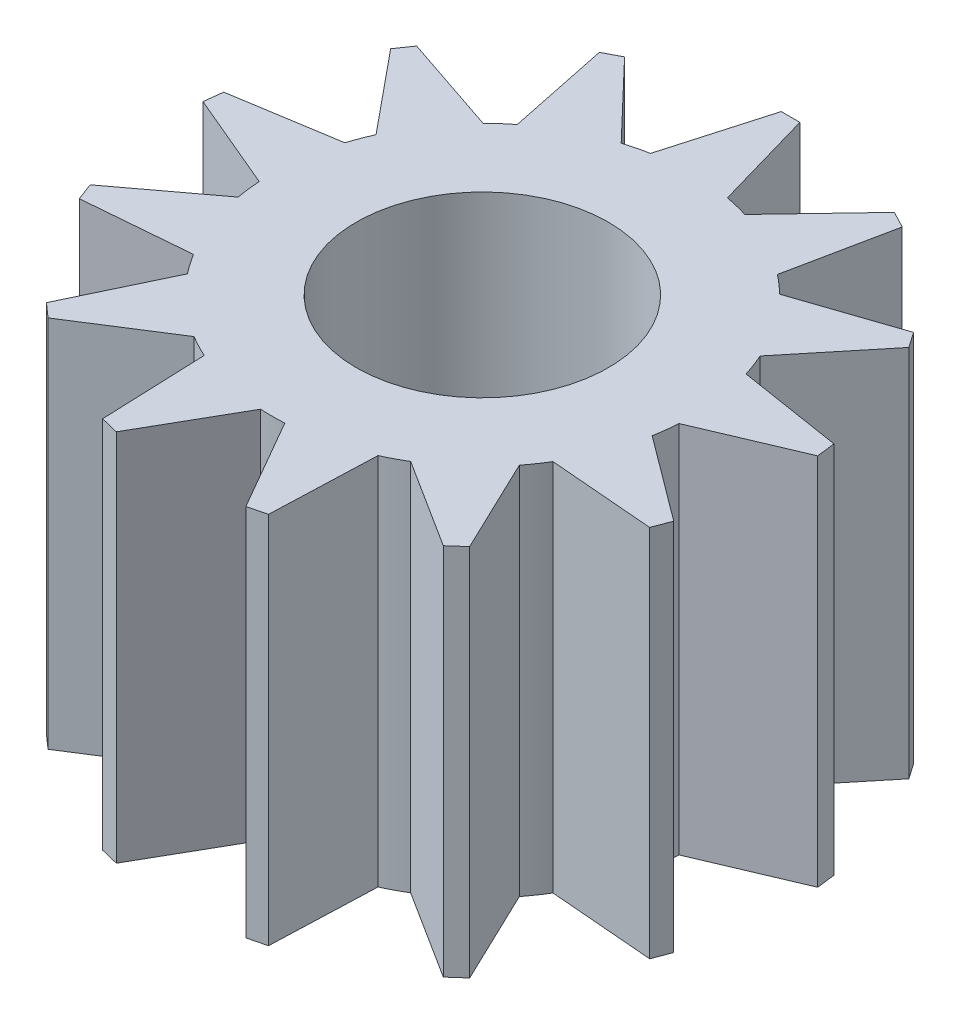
from build123d import *

# Parameters (mm, degrees)
SKETCH_1_R               = 4.5
SKETCH_1_R_2             = 2.7
EXTRUDE_1_DEPTH          = 8
EXTRUDE_2_DEPTH          = 8
PATTERN_CIRCULAR_1_COUNT = 13
PATTERN_CIRCULAR_1_ANGLE = 332.4


with BuildPart() as part:
    # Sketch 1 → Extrude 1 (new body)
    with BuildSketch(Plane(origin=(0, 0, 0), x_dir=(1, 0, 0), z_dir=(0, 1, 0))):
        with Locations(Location((-6.516055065, 1.577878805, 0), (0, 0, 270))):
            Circle(SKETCH_1_R)
        with Locations(Location((-6.516055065, 1.577878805, 0), (0, 0, 270))):
            Circle(SKETCH_1_R_2, mode=Mode.SUBTRACT)
    extrude(amount=EXTRUDE_1_DEPTH)

    # Sketch 1_3 → Extrude 2 (add)
    with BuildSketch(Plane(origin=(0, 0, 0), x_dir=(1, 0, 0), z_dir=(0, 1, 0))):
        with BuildLine():
            Line((-6.316055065, 8.177878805), (-6.516055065, 8.177878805))
            Line((-6.516055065, 8.177878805), (-6.716055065, 8.177878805))
            Line((-6.716055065, 8.177878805), (-7.340036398, 6.00179729))
            ThreePointArc((-7.340036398, 6.00179729), (-6.516055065, 6.077878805), (-5.692073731, 6.00179729))
            Line((-5.692073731, 6.00179729), (-6.316055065, 8.177878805))
        make_face()
    extrude_2 = extrude(amount=EXTRUDE_2_DEPTH)

    # Pattern Circular 1: Extrude 2 ×13 about axis
    pattern_circular_1_axis = Axis((-6.516055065, 0, -1.577878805), (0, 1, 0))
    for i in range(1, PATTERN_CIRCULAR_1_COUNT):
        add(extrude_2.rotate(pattern_circular_1_axis, i * PATTERN_CIRCULAR_1_ANGLE / (PATTERN_CIRCULAR_1_COUNT - 1)))


solid = part.part
